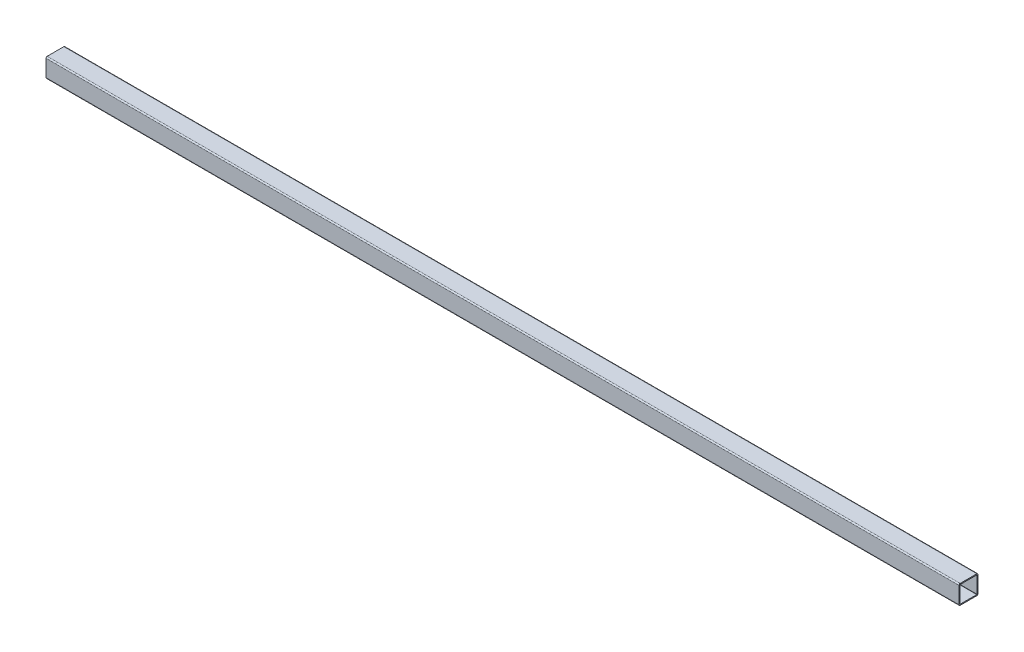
from build123d import *

# Parameters (mm, degrees)
EXTRUDE1_DEPTH = 1219.2


with BuildPart() as part:
    # Sketch1 → Extrude1 (new body)
    with BuildSketch(Plane(origin=(0, 0, 0), x_dir=(0, 0, -1), z_dir=(1, 0, 0))):
        with BuildLine():
            Line((-5.373037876, 5.244240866), (16.851962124, 5.244240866))
            ThreePointArc((16.851962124, 5.244240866), (17.974494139, 4.779272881), (18.439462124, 3.656740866))
            Line((18.439462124, 3.656740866), (18.439462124, -18.568259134))
            ThreePointArc((18.439462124, -18.568259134), (17.974494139, -19.690791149), (16.851962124, -20.155759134))
            Line((16.851962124, -20.155759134), (-5.373037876, -20.155759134))
            ThreePointArc((-5.373037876, -20.155759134), (-6.495569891, -19.690791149), (-6.960537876, -18.568259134))
            Line((-6.960537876, -18.568259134), (-6.960537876, 3.656740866))
            ThreePointArc((-6.960537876, 3.656740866), (-6.495569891, 4.779272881), (-5.373037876, 5.244240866))
        make_face()
        with BuildLine():
            Line((-5.373037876, 3.898040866), (16.851962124, 3.898040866))
            ThreePointArc((16.851962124, 3.898040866), (17.02258699, 3.827365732), (17.093262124, 3.656740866))
            Line((17.093262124, 3.656740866), (17.093262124, -18.568259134))
            ThreePointArc((17.093262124, -18.568259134), (17.02258699, -18.738884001), (16.851962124, -18.809559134))
            Line((16.851962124, -18.809559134), (-5.373037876, -18.809559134))
            ThreePointArc((-5.373037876, -18.809559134), (-5.543662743, -18.738884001), (-5.614337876, -18.568259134))
            Line((-5.614337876, -18.568259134), (-5.614337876, 3.656740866))
            ThreePointArc((-5.614337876, 3.656740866), (-5.543662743, 3.827365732), (-5.373037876, 3.898040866))
        make_face(mode=Mode.SUBTRACT)
    extrude(amount=EXTRUDE1_DEPTH)


solid = part.part
